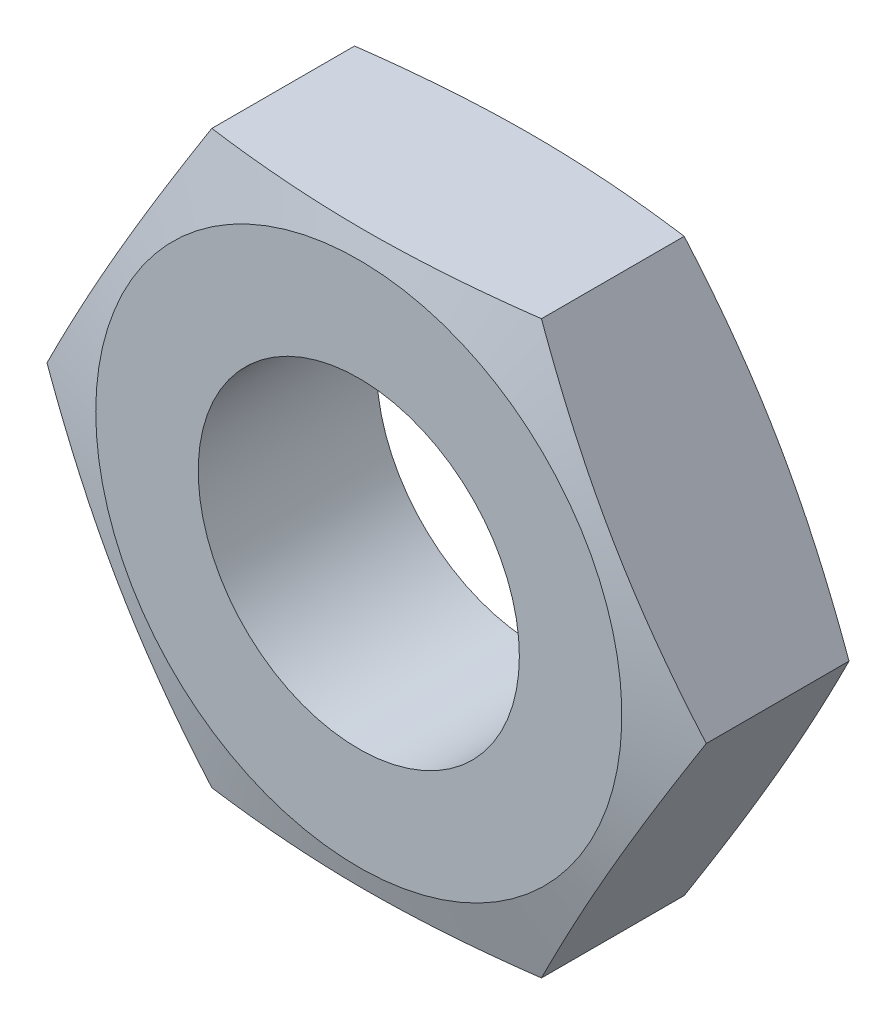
from build123d import *

# Parameters (mm, degrees)
ESQUISSE1_R          = 4.5
BASE_EXTRUSION_DEPTH = 2.5


with BuildPart() as part:
    # Esquisse1 → Base-Extrusion (new, symmetric)
    with BuildSketch(Plane.XY):
        Polygon((-4.618802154, 8), (4.618802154, 8), (9.237604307, 0), (4.618802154, -8), (-4.618802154, -8), (-9.237604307, 0), align=None)
        Circle(ESQUISSE1_R, mode=Mode.SUBTRACT)
    extrude(amount=BASE_EXTRUSION_DEPTH, both=True)

    # Esquisse2 → Enlever de la mati_re-R_volution1 (revolve, cut)
    with BuildSketch(Plane(origin=(0, 0, 0), x_dir=(1, 0, 0), z_dir=(0, 1, 0)), mode=Mode.PRIVATE) as enlever_de_la_mati_re_r_volution1_sk:
        Polygon((7.371578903, 2.5), (9.237604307, 2.5), (9.237604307, 2), align=None)
    revolve(enlever_de_la_mati_re_r_volution1_sk.sketch.rotate(Axis((0, 0, -4.395964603), (0, 0, 1)), 179.999999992), axis=Axis((0, 0, -4.395964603), (0, 0, 1)), mode=Mode.SUBTRACT)

    # Esquisse3 → Enlever de la mati_re-R_volution2 (revolve, cut)
    with BuildSketch(Plane(origin=(0, 0, 0), x_dir=(1, 0, 0), z_dir=(0, 1, 0)), mode=Mode.PRIVATE) as enlever_de_la_mati_re_r_volution2_sk:
        Polygon((9.237604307, -2.5), (9.237604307, -2), (7.371578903, -2.5), align=None)
    revolve(enlever_de_la_mati_re_r_volution2_sk.sketch.rotate(Axis((0, 0, -3.467006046), (0, 0, 1)), 180), axis=Axis((0, 0, -3.467006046), (0, 0, 1)), mode=Mode.SUBTRACT)


solid = part.part
